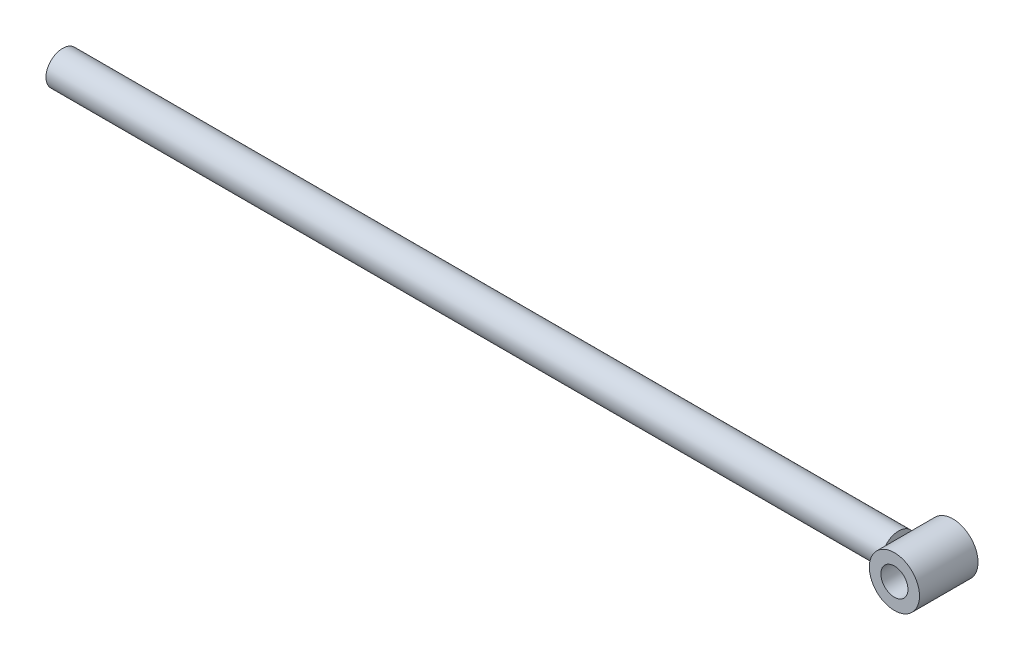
ISO-10303-21;
HEADER;
FILE_DESCRIPTION(('STEP AP214'),'2;1');
FILE_NAME('part.step','',(''),(''),'','','');
FILE_SCHEMA(('AUTOMOTIVE_DESIGN { 1 0 10303 214 1 1 1 1 }'));
ENDSEC;
DATA;
#1=APPLICATION_CONTEXT('core data for automotive mechanical design processes');
#2=APPLICATION_PROTOCOL_DEFINITION('international standard','automotive_design',2000,#1);
#3=PRODUCT_CONTEXT('',#1,'mechanical');
#4=PRODUCT('Part','Part','',(#3));
#5=PRODUCT_RELATED_PRODUCT_CATEGORY('part','',(#4));
#6=PRODUCT_DEFINITION_FORMATION('','',#4);
#7=PRODUCT_DEFINITION_CONTEXT('part definition',#1,'design');
#8=PRODUCT_DEFINITION('design','',#6,#7);
#9=PRODUCT_DEFINITION_SHAPE('','',#8);
#10=(LENGTH_UNIT() NAMED_UNIT(*) SI_UNIT(.MILLI.,.METRE.));
#11=(NAMED_UNIT(*) PLANE_ANGLE_UNIT() SI_UNIT($,.RADIAN.));
#12=(NAMED_UNIT(*) SI_UNIT($,.STERADIAN.) SOLID_ANGLE_UNIT());
#13=UNCERTAINTY_MEASURE_WITH_UNIT(LENGTH_MEASURE(1.E-05),#10,'distance_accuracy_value','');
#14=(GEOMETRIC_REPRESENTATION_CONTEXT(3) GLOBAL_UNCERTAINTY_ASSIGNED_CONTEXT((#13)) GLOBAL_UNIT_ASSIGNED_CONTEXT((#10,
#11,#12)) REPRESENTATION_CONTEXT('',''));
#15=CARTESIAN_POINT('',(0.,0.,0.));
#16=DIRECTION('',(0.,0.,1.));
#17=DIRECTION('',(1.,0.,0.));
#18=AXIS2_PLACEMENT_3D('',#15,#16,#17);
#19=CARTESIAN_POINT('',(515.,0.,17.5));
#20=DIRECTION('',(0.,0.,1.));
#21=DIRECTION('',(1.,0.,0.));
#22=AXIS2_PLACEMENT_3D('',#19,#20,#21);
#23=PLANE('',#22);
#24=CARTESIAN_POINT('',(515.,0.,17.5));
#25=DIRECTION('',(0.,0.,1.));
#26=DIRECTION('',(1.,0.,0.));
#27=AXIS2_PLACEMENT_3D('',#24,#25,#26);
#28=CIRCLE('',#27,15.);
#29=CARTESIAN_POINT('',(530.,0.,17.5));
#30=VERTEX_POINT('',#29);
#31=EDGE_CURVE('E11',#30,#30,#28,.T.);
#32=ORIENTED_EDGE('',*,*,#31,.T.);
#33=EDGE_LOOP('',(#32));
#34=FACE_BOUND('',#33,.T.);
#35=CARTESIAN_POINT('',(515.,0.,17.5));
#36=DIRECTION('',(0.,0.,1.));
#37=DIRECTION('',(1.,0.,0.));
#38=AXIS2_PLACEMENT_3D('',#35,#36,#37);
#39=CIRCLE('',#38,8.10000000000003);
#40=CARTESIAN_POINT('',(523.1,0.,17.5));
#41=VERTEX_POINT('',#40);
#42=EDGE_CURVE('E48',#41,#41,#39,.T.);
#43=ORIENTED_EDGE('',*,*,#42,.F.);
#44=EDGE_LOOP('',(#43));
#45=FACE_BOUND('',#44,.T.);
#46=ADVANCED_FACE('F37',(#34,#45),#23,.T.);
#47=CARTESIAN_POINT('',(515.,0.,-17.5));
#48=DIRECTION('',(0.,0.,1.));
#49=DIRECTION('',(1.,0.,0.));
#50=AXIS2_PLACEMENT_3D('',#47,#48,#49);
#51=PLANE('',#50);
#52=CARTESIAN_POINT('',(515.,0.,-17.5));
#53=DIRECTION('',(0.,0.,1.));
#54=DIRECTION('',(1.,0.,0.));
#55=AXIS2_PLACEMENT_3D('',#52,#53,#54);
#56=CIRCLE('',#55,15.);
#57=CARTESIAN_POINT('',(530.,0.,-17.5));
#58=VERTEX_POINT('',#57);
#59=EDGE_CURVE('E41',#58,#58,#56,.T.);
#60=ORIENTED_EDGE('',*,*,#59,.F.);
#61=EDGE_LOOP('',(#60));
#62=FACE_BOUND('',#61,.T.);
#63=CARTESIAN_POINT('',(515.,0.,-17.5));
#64=DIRECTION('',(0.,0.,1.));
#65=DIRECTION('',(1.,0.,0.));
#66=AXIS2_PLACEMENT_3D('',#63,#64,#65);
#67=CIRCLE('',#66,8.10000000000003);
#68=CARTESIAN_POINT('',(523.1,0.,-17.5));
#69=VERTEX_POINT('',#68);
#70=EDGE_CURVE('E50',#69,#69,#67,.T.);
#71=ORIENTED_EDGE('',*,*,#70,.T.);
#72=EDGE_LOOP('',(#71));
#73=FACE_BOUND('',#72,.T.);
#74=ADVANCED_FACE('F60',(#62,#73),#51,.F.);
#75=CARTESIAN_POINT('',(515.,0.,17.5));
#76=DIRECTION('',(0.,0.,-1.));
#77=DIRECTION('',(-1.,0.,0.));
#78=AXIS2_PLACEMENT_3D('',#75,#76,#77);
#79=CYLINDRICAL_SURFACE('',#78,15.);
#80=ORIENTED_EDGE('',*,*,#31,.F.);
#81=EDGE_LOOP('',(#80));
#82=FACE_BOUND('',#81,.T.);
#83=ORIENTED_EDGE('',*,*,#59,.T.);
#84=EDGE_LOOP('',(#83));
#85=FACE_BOUND('',#84,.T.);
#86=ADVANCED_FACE('F39',(#82,#85),#79,.T.);
#87=CARTESIAN_POINT('',(515.,0.,17.5));
#88=DIRECTION('',(0.,0.,-1.));
#89=DIRECTION('',(-1.,0.,0.));
#90=AXIS2_PLACEMENT_3D('',#87,#88,#89);
#91=CYLINDRICAL_SURFACE('',#90,8.10000000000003);
#92=ORIENTED_EDGE('',*,*,#42,.T.);
#93=EDGE_LOOP('',(#92));
#94=FACE_BOUND('',#93,.T.);
#95=ORIENTED_EDGE('',*,*,#70,.F.);
#96=EDGE_LOOP('',(#95));
#97=FACE_BOUND('',#96,.T.);
#98=ADVANCED_FACE('F56',(#94,#97),#91,.F.);
#99=CLOSED_SHELL('',(#46,#74,#86,#98));
#100=MANIFOLD_SOLID_BREP('B2',#99);
#101=CARTESIAN_POINT('',(500.,0.,0.));
#102=DIRECTION('',(-1.,0.,0.));
#103=DIRECTION('',(0.,0.,1.));
#104=AXIS2_PLACEMENT_3D('',#101,#102,#103);
#105=CYLINDRICAL_SURFACE('',#104,10.);
#106=CARTESIAN_POINT('',(500.,0.,0.));
#107=DIRECTION('',(1.,0.,0.));
#108=DIRECTION('',(0.,0.,-1.));
#109=AXIS2_PLACEMENT_3D('',#106,#107,#108);
#110=CIRCLE('',#109,10.);
#111=CARTESIAN_POINT('',(500.,0.,-10.));
#112=VERTEX_POINT('',#111);
#113=EDGE_CURVE('E36',#112,#112,#110,.T.);
#114=ORIENTED_EDGE('',*,*,#113,.F.);
#115=EDGE_LOOP('',(#114));
#116=FACE_BOUND('',#115,.T.);
#117=CARTESIAN_POINT('',(0.,0.,0.));
#118=DIRECTION('',(1.,0.,0.));
#119=DIRECTION('',(0.,0.,-1.));
#120=AXIS2_PLACEMENT_3D('',#117,#118,#119);
#121=CIRCLE('',#120,10.);
#122=CARTESIAN_POINT('',(0.,0.,-10.));
#123=VERTEX_POINT('',#122);
#124=EDGE_CURVE('E102',#123,#123,#121,.T.);
#125=ORIENTED_EDGE('',*,*,#124,.T.);
#126=EDGE_LOOP('',(#125));
#127=FACE_BOUND('',#126,.T.);
#128=ADVANCED_FACE('F99',(#116,#127),#105,.T.);
#129=CARTESIAN_POINT('',(500.,0.,0.));
#130=DIRECTION('',(1.,0.,0.));
#131=DIRECTION('',(0.,0.,-1.));
#132=AXIS2_PLACEMENT_3D('',#129,#130,#131);
#133=PLANE('',#132);
#134=ORIENTED_EDGE('',*,*,#113,.T.);
#135=EDGE_LOOP('',(#134));
#136=FACE_BOUND('',#135,.T.);
#137=ADVANCED_FACE('F114',(#136),#133,.T.);
#138=CARTESIAN_POINT('',(0.,0.,0.));
#139=DIRECTION('',(1.,0.,0.));
#140=DIRECTION('',(0.,0.,-1.));
#141=AXIS2_PLACEMENT_3D('',#138,#139,#140);
#142=PLANE('',#141);
#143=ORIENTED_EDGE('',*,*,#124,.F.);
#144=EDGE_LOOP('',(#143));
#145=FACE_BOUND('',#144,.T.);
#146=ADVANCED_FACE('F112',(#145),#142,.F.);
#147=CLOSED_SHELL('',(#128,#137,#146));
#148=MANIFOLD_SOLID_BREP('B6',#147);
#149=ADVANCED_BREP_SHAPE_REPRESENTATION('',(#18,#100,#148),#14);
#150=SHAPE_DEFINITION_REPRESENTATION(#9,#149);
ENDSEC;
END-ISO-10303-21;
